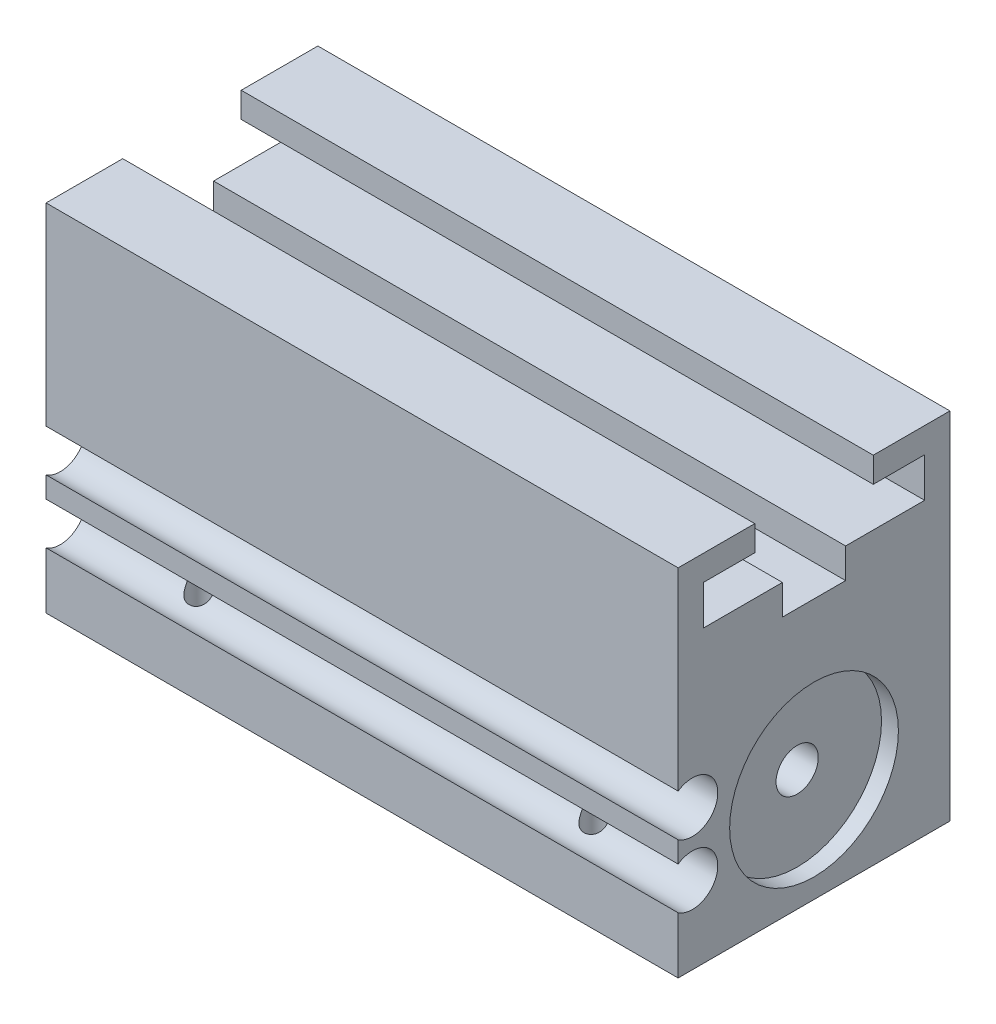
from build123d import *

# Parameters (mm, degrees)
EXTRUDE1_DEPTH     = 50.8
SKETCH2_R          = 6.7818
CUT_EXTRUDE1_DEPTH = 1.35636
SKETCH3_R          = 1.20269
CUT_EXTRUDE2_DEPTH = 3.048
SKETCH4_R          = 1.20269
CUT_EXTRUDE3_DEPTH = 3.048
CUT_EXTRUDE4_START = 1.35636
SKETCH9_R          = 6.7818
CUT_EXTRUDE4_DEPTH = 1.35636
SKETCH14_R         = 1.20269
CUT_EXTRUDE5_DEPTH = 3.175
SKETCH15_R         = 1.20269
CUT_EXTRUDE6_DEPTH = 3.175
SKETCH17_W         = 40.64
SKETCH17_H         = 1.69545


with BuildPart() as part:
    # Sketch1 → Extrude1 (new body)
    with BuildSketch(Plane(origin=(0, 0, 0), x_dir=(0, 0, -1), z_dir=(1, 0, 0))):
        with BuildLine():
            Line((-10.922, -14.2748), (10.922, -14.2748))
            Line((10.922, -14.2748), (10.922, 14.2748))
            Line((10.922, 14.2748), (4.7625, 14.2748))
            Line((4.7625, 14.2748), (4.7625, 12.2428))
            Line((4.7625, 12.2428), (8.89, 12.2428))
            Line((8.89, 12.2428), (8.89, 9.0678))
            Line((8.89, 9.0678), (2.54, 9.0678))
            Line((2.54, 9.0678), (2.54, 6.6548))
            Line((2.54, 6.6548), (-2.54, 6.6548))
            Line((-2.54, 6.6548), (-2.54, 9.0678))
            Line((-2.54, 9.0678), (-8.89, 9.0678))
            Line((-8.89, 9.0678), (-8.89, 12.2428))
            Line((-8.89, 12.2428), (-4.7625, 12.2428))
            Line((-4.7625, 12.2428), (-4.7625, 14.2748))
            Line((-4.7625, 14.2748), (-10.922, 14.2748))
            Line((-10.922, 14.2748), (-10.922, -1.264979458))
            ThreePointArc((-10.922, -1.264979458), (-7.7343, -2.96037), (-10.922, -4.655760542))
            Line((-10.922, -4.655760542), (-10.922, -6.344979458))
            ThreePointArc((-10.922, -6.344979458), (-7.7343, -8.04037), (-10.922, -9.735760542))
            Line((-10.922, -9.735760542), (-10.922, -14.2748))
        make_face()
    extrude(amount=EXTRUDE1_DEPTH)

    # Sketch2 → Cut-Extrude1 (cut)
    with BuildSketch(Plane(origin=(50.8, 0, 0), x_dir=(0, 0, -1), z_dir=(1, 0, 0))):
        with Locations((0, -5.9182)):
            Circle(SKETCH2_R)
    extrude(amount=-CUT_EXTRUDE1_DEPTH, mode=Mode.SUBTRACT)

    # Sketch3 → Cut-Extrude2 (cut)
    with BuildSketch(Plane(origin=(0, 0, 0), x_dir=(0, 0, -1), z_dir=(1, 0, 0))):
        with Locations(Location((8.7249, 4.3942, 0), (0, 0, 180))):
            Circle(SKETCH3_R)
    extrude(amount=CUT_EXTRUDE2_DEPTH, mode=Mode.SUBTRACT)

    # Sketch4 → Cut-Extrude3 (cut)
    with BuildSketch(Plane(origin=(0, 0, 0), x_dir=(0, 0, -1), z_dir=(1, 0, 0))):
        with Locations(Location((-8.7249, -11.4808, 0), (0, 0, 180))):
            Circle(SKETCH4_R)
    extrude(amount=CUT_EXTRUDE3_DEPTH, mode=Mode.SUBTRACT)

    # Sketch5 → Cut-Revolve1 (revolve, cut)
    with BuildSketch(Plane.XY.offset(8.7249), mode=Mode.PRIVATE) as cut_revolve1_sk:
        Polygon((0, 4.3942), (0, 5.7912), (0.381, 5.4102), (6.271412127, 5.4102), (6.858, 4.3942), align=None)
    revolve(cut_revolve1_sk.sketch.rotate(Axis((6.858, 4.3942, 8.7249), (-1, 0, 0)), 270), axis=Axis((6.858, 4.3942, 8.7249), (-1, 0, 0)), mode=Mode.SUBTRACT)

    # Sketch6 → Cut-Revolve2 (revolve, cut)
    with BuildSketch(Plane.XY.offset(-8.7249), mode=Mode.PRIVATE) as cut_revolve2_sk:
        Polygon((0, -11.4808), (0, -10.0838), (0.381, -10.4648), (6.271412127, -10.4648), (6.858, -11.4808), align=None)
    revolve(cut_revolve2_sk.sketch.rotate(Axis((6.858, -11.4808, -8.7249), (-1, 0, 0)), 270), axis=Axis((6.858, -11.4808, -8.7249), (-1, 0, 0)), mode=Mode.SUBTRACT)

    # Sketch7 → Cut-Revolve3 (revolve, cut)
    with BuildSketch(Plane(origin=(7.62, 0, 0), x_dir=(0, 0, -1), z_dir=(1, 0, 0)), mode=Mode.PRIVATE) as cut_revolve3_sk:
        Polygon((6.35, 1.5748), (6.35, 3.5179), (10.4521, 3.5179), (10.922, 3.9878), (10.922, 1.5748), align=None)
    revolve(cut_revolve3_sk.sketch.rotate(Axis((7.62, 1.5748, -10.922), (0, 0, 1)), 270), axis=Axis((7.62, 1.5748, -10.922), (0, 0, 1)), mode=Mode.SUBTRACT)

    # Sketch8 → Cut-Revolve4 (revolve, cut)
    with BuildSketch(Plane(origin=(43.434, 0, 0), x_dir=(0, 0, -1), z_dir=(1, 0, 0)), mode=Mode.PRIVATE) as cut_revolve4_sk:
        Polygon((6.35, 1.5748), (6.35, 3.5179), (10.4521, 3.5179), (10.922, 3.9878), (10.922, 1.5748), align=None)
    revolve(cut_revolve4_sk.sketch.rotate(Axis((43.434, 1.5748, -10.922), (0, 0, 1)), 270), axis=Axis((43.434, 1.5748, -10.922), (0, 0, 1)), mode=Mode.SUBTRACT)

    # Sketch9 → Cut-Extrude4 (cut)
    with BuildSketch(Plane(origin=(0, 0, 0), x_dir=(0, 0, -1), z_dir=(1, 0, 0)).offset(CUT_EXTRUDE4_START)):
        with Locations((0, -5.9182)):
            Circle(SKETCH9_R)
    extrude(amount=-CUT_EXTRUDE4_DEPTH, mode=Mode.SUBTRACT)

    # Sketch10 → Cut-Revolve5 (revolve, cut)
    with BuildSketch(Plane(origin=(9.525, 0, 0), x_dir=(0, 0, -1), z_dir=(1, 0, 0)), mode=Mode.PRIVATE) as cut_revolve5_sk:
        Polygon((-7.9375, -14.2748), (-9.3345, -14.2748), (-8.9535, -13.8938), (-8.9535, -8.917787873), (-7.9375, -8.3312), align=None)
    revolve(cut_revolve5_sk.sketch.rotate(Axis((9.525, -8.3312, 7.9375), (0, -1, 0)), 180), axis=Axis((9.525, -8.3312, 7.9375), (0, -1, 0)), mode=Mode.SUBTRACT)

    # Sketch11 → Cut-Revolve6 (revolve, cut)
    with BuildSketch(Plane(origin=(41.275, 0, 0), x_dir=(0, 0, -1), z_dir=(1, 0, 0)), mode=Mode.PRIVATE) as cut_revolve6_sk:
        Polygon((-7.9375, -14.2748), (-9.3345, -14.2748), (-8.9535, -13.8938), (-8.9535, -8.917787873), (-7.9375, -8.3312), align=None)
    revolve(cut_revolve6_sk.sketch.rotate(Axis((41.275, -8.3312, 7.9375), (0, -1, 0)), 180), axis=Axis((41.275, -8.3312, 7.9375), (0, -1, 0)), mode=Mode.SUBTRACT)

    # Sketch12 → Cut-Revolve7 (revolve, cut)
    with BuildSketch(Plane(origin=(41.275, 0, 0), x_dir=(0, 0, -1), z_dir=(1, 0, 0)), mode=Mode.PRIVATE) as cut_revolve7_sk:
        Polygon((7.9375, -14.2748), (6.5405, -14.2748), (6.9215, -13.8938), (6.9215, -8.917787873), (7.9375, -8.3312), align=None)
    revolve(cut_revolve7_sk.sketch.rotate(Axis((41.275, -8.3312, -7.9375), (0, -1, 0)), 180), axis=Axis((41.275, -8.3312, -7.9375), (0, -1, 0)), mode=Mode.SUBTRACT)

    # Sketch13 → Cut-Revolve8 (revolve, cut)
    with BuildSketch(Plane(origin=(9.525, 0, 0), x_dir=(0, 0, -1), z_dir=(1, 0, 0)), mode=Mode.PRIVATE) as cut_revolve8_sk:
        Polygon((7.9375, -14.2748), (6.5405, -14.2748), (6.9215, -13.8938), (6.9215, -8.917787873), (7.9375, -8.3312), align=None)
    revolve(cut_revolve8_sk.sketch.rotate(Axis((9.525, -8.3312, -7.9375), (0, -1, 0)), 180), axis=Axis((9.525, -8.3312, -7.9375), (0, -1, 0)), mode=Mode.SUBTRACT)

    # Sketch14 → Cut-Extrude5 (cut)
    with BuildSketch(Plane(origin=(0, -14.2748, 0), x_dir=(-1, 0, 0), z_dir=(0, 1, 0))):
        with Locations(Location((-15.875, 7.9375, 0), (0, 0, 90))):
            Circle(SKETCH14_R)
    extrude(amount=CUT_EXTRUDE5_DEPTH, mode=Mode.SUBTRACT)

    # Sketch15 → Cut-Extrude6 (cut)
    with BuildSketch(Plane(origin=(0, -14.2748, 0), x_dir=(-1, 0, 0), z_dir=(0, 1, 0))):
        with Locations(Location((-34.925, -7.9375, 0), (0, 0, 90))):
            Circle(SKETCH15_R)
    extrude(amount=CUT_EXTRUDE6_DEPTH, mode=Mode.SUBTRACT)

    # Sketch16 → Cut-Revolve9 (revolve, cut)
    with BuildSketch(Plane.XY, mode=Mode.PRIVATE) as cut_revolve9_sk:
        Polygon((0, 2.8067), (0, 4.8387), (0.381, 4.4577), (3.048, 4.4577), (3.048, 2.8067), align=None)
    revolve(cut_revolve9_sk.sketch.rotate(Axis((3.048, 2.8067, 0), (-1, 0, 0)), 270), axis=Axis((3.048, 2.8067, 0), (-1, 0, 0)), mode=Mode.SUBTRACT)

    # Sketch17 → Cut-Revolve10 (revolve, cut)
    with BuildSketch(Plane.XY, mode=Mode.PRIVATE) as cut_revolve10_sk:
        with Locations((29.12364, -5.070475)):
            Rectangle(SKETCH17_W, SKETCH17_H)
    revolve(cut_revolve10_sk.sketch.rotate(Axis((49.44364, -5.9182, 0), (-1, 0, 0)), 355.571026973), axis=Axis((49.44364, -5.9182, 0), (-1, 0, 0)), mode=Mode.SUBTRACT)


solid = part.part
